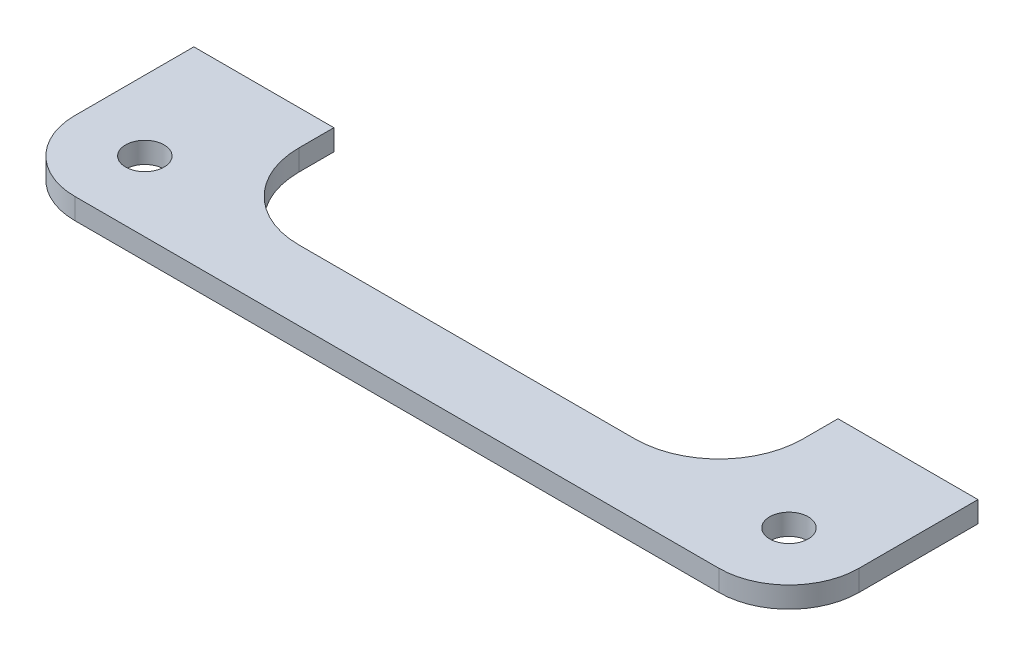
ISO-10303-21;
HEADER;
FILE_DESCRIPTION(('STEP AP214'),'2;1');
FILE_NAME('part.step','',(''),(''),'','','');
FILE_SCHEMA(('AUTOMOTIVE_DESIGN { 1 0 10303 214 1 1 1 1 }'));
ENDSEC;
DATA;
#1=APPLICATION_CONTEXT('core data for automotive mechanical design processes');
#2=APPLICATION_PROTOCOL_DEFINITION('international standard','automotive_design',2000,#1);
#3=PRODUCT_CONTEXT('',#1,'mechanical');
#4=PRODUCT('Part','Part','',(#3));
#5=PRODUCT_RELATED_PRODUCT_CATEGORY('part','',(#4));
#6=PRODUCT_DEFINITION_FORMATION('','',#4);
#7=PRODUCT_DEFINITION_CONTEXT('part definition',#1,'design');
#8=PRODUCT_DEFINITION('design','',#6,#7);
#9=PRODUCT_DEFINITION_SHAPE('','',#8);
#10=(LENGTH_UNIT() NAMED_UNIT(*) SI_UNIT(.MILLI.,.METRE.));
#11=(NAMED_UNIT(*) PLANE_ANGLE_UNIT() SI_UNIT($,.RADIAN.));
#12=(NAMED_UNIT(*) SI_UNIT($,.STERADIAN.) SOLID_ANGLE_UNIT());
#13=UNCERTAINTY_MEASURE_WITH_UNIT(LENGTH_MEASURE(1.E-05),#10,'distance_accuracy_value','');
#14=(GEOMETRIC_REPRESENTATION_CONTEXT(3) GLOBAL_UNCERTAINTY_ASSIGNED_CONTEXT((#13)) GLOBAL_UNIT_ASSIGNED_CONTEXT((#10,
#11,#12)) REPRESENTATION_CONTEXT('',''));
#15=CARTESIAN_POINT('',(0.,0.,0.));
#16=DIRECTION('',(0.,0.,1.));
#17=DIRECTION('',(1.,0.,0.));
#18=AXIS2_PLACEMENT_3D('',#15,#16,#17);
#19=CARTESIAN_POINT('',(102.,3.,-10.));
#20=DIRECTION('',(0.,1.,0.));
#21=DIRECTION('',(0.,0.,1.));
#22=AXIS2_PLACEMENT_3D('',#19,#20,#21);
#23=PLANE('',#22);
#24=CARTESIAN_POINT('',(10.,3.,-10.));
#25=DIRECTION('',(0.,1.,0.));
#26=DIRECTION('',(0.,0.,1.));
#27=AXIS2_PLACEMENT_3D('',#24,#25,#26);
#28=CIRCLE('',#27,2.75);
#29=CARTESIAN_POINT('',(10.,3.,-7.25));
#30=VERTEX_POINT('',#29);
#31=EDGE_CURVE('E156',#30,#30,#28,.T.);
#32=ORIENTED_EDGE('',*,*,#31,.F.);
#33=EDGE_LOOP('',(#32));
#34=FACE_BOUND('',#33,.T.);
#35=CARTESIAN_POINT('',(102.,3.,-10.));
#36=DIRECTION('',(0.,1.,0.));
#37=DIRECTION('',(0.,0.,1.));
#38=AXIS2_PLACEMENT_3D('',#35,#36,#37);
#39=CIRCLE('',#38,10.);
#40=CARTESIAN_POINT('',(102.,3.,0.));
#41=VERTEX_POINT('',#40);
#42=CARTESIAN_POINT('',(112.,3.,-10.0000000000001));
#43=VERTEX_POINT('',#42);
#44=EDGE_CURVE('E175',#41,#43,#39,.T.);
#45=ORIENTED_EDGE('',*,*,#44,.T.);
#46=DIRECTION('',(0.,0.,-1.));
#47=VECTOR('',#46,1.);
#48=CARTESIAN_POINT('',(112.,3.,-10.0000000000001));
#49=LINE('',#48,#47);
#50=CARTESIAN_POINT('',(112.,3.,-27.));
#51=VERTEX_POINT('',#50);
#52=EDGE_CURVE('E103',#43,#51,#49,.T.);
#53=ORIENTED_EDGE('',*,*,#52,.T.);
#54=DIRECTION('',(-1.,0.,0.));
#55=VECTOR('',#54,1.);
#56=CARTESIAN_POINT('',(112.,3.,-27.));
#57=LINE('',#56,#55);
#58=CARTESIAN_POINT('',(92.,3.,-27.));
#59=VERTEX_POINT('',#58);
#60=EDGE_CURVE('E202',#51,#59,#57,.T.);
#61=ORIENTED_EDGE('',*,*,#60,.T.);
#62=DIRECTION('',(0.,0.,1.));
#63=VECTOR('',#62,1.);
#64=CARTESIAN_POINT('',(92.,3.,-27.));
#65=LINE('',#64,#63);
#66=CARTESIAN_POINT('',(92.,3.,-22.0000000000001));
#67=VERTEX_POINT('',#66);
#68=EDGE_CURVE('E221',#59,#67,#65,.T.);
#69=ORIENTED_EDGE('',*,*,#68,.T.);
#70=CARTESIAN_POINT('',(80.,3.,-22.));
#71=DIRECTION('',(0.,-1.,0.));
#72=DIRECTION('',(0.,0.,1.));
#73=AXIS2_PLACEMENT_3D('',#70,#71,#72);
#74=CIRCLE('',#73,12.);
#75=CARTESIAN_POINT('',(79.9999999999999,3.,-10.));
#76=VERTEX_POINT('',#75);
#77=EDGE_CURVE('E218',#67,#76,#74,.T.);
#78=ORIENTED_EDGE('',*,*,#77,.T.);
#79=DIRECTION('',(-1.,0.,0.));
#80=VECTOR('',#79,1.);
#81=CARTESIAN_POINT('',(79.9999999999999,3.,-10.));
#82=LINE('',#81,#80);
#83=CARTESIAN_POINT('',(32.0000000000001,3.,-9.99999999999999));
#84=VERTEX_POINT('',#83);
#85=EDGE_CURVE('E220',#76,#84,#82,.T.);
#86=ORIENTED_EDGE('',*,*,#85,.T.);
#87=CARTESIAN_POINT('',(32.,3.,-22.));
#88=DIRECTION('',(0.,-1.,0.));
#89=DIRECTION('',(0.,0.,-1.));
#90=AXIS2_PLACEMENT_3D('',#87,#88,#89);
#91=CIRCLE('',#90,12.);
#92=CARTESIAN_POINT('',(20.,3.,-22.0000000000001));
#93=VERTEX_POINT('',#92);
#94=EDGE_CURVE('E223',#84,#93,#91,.T.);
#95=ORIENTED_EDGE('',*,*,#94,.T.);
#96=DIRECTION('',(0.,0.,-1.));
#97=VECTOR('',#96,1.);
#98=CARTESIAN_POINT('',(20.,3.,-22.0000000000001));
#99=LINE('',#98,#97);
#100=CARTESIAN_POINT('',(20.,3.,-27.));
#101=VERTEX_POINT('',#100);
#102=EDGE_CURVE('E229',#93,#101,#99,.T.);
#103=ORIENTED_EDGE('',*,*,#102,.T.);
#104=DIRECTION('',(-1.,0.,0.));
#105=VECTOR('',#104,1.);
#106=CARTESIAN_POINT('',(20.,3.,-27.));
#107=LINE('',#106,#105);
#108=CARTESIAN_POINT('',(0.,3.,-27.));
#109=VERTEX_POINT('',#108);
#110=EDGE_CURVE('E134',#101,#109,#107,.T.);
#111=ORIENTED_EDGE('',*,*,#110,.T.);
#112=DIRECTION('',(0.,0.,1.));
#113=VECTOR('',#112,1.);
#114=CARTESIAN_POINT('',(0.,3.,-27.));
#115=LINE('',#114,#113);
#116=CARTESIAN_POINT('',(0.,3.,-10.0000000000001));
#117=VERTEX_POINT('',#116);
#118=EDGE_CURVE('E128',#109,#117,#115,.T.);
#119=ORIENTED_EDGE('',*,*,#118,.T.);
#120=CARTESIAN_POINT('',(10.,3.,-10.));
#121=DIRECTION('',(0.,1.,0.));
#122=DIRECTION('',(0.,0.,-1.));
#123=AXIS2_PLACEMENT_3D('',#120,#121,#122);
#124=CIRCLE('',#123,10.);
#125=CARTESIAN_POINT('',(10.0000000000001,3.,0.));
#126=VERTEX_POINT('',#125);
#127=EDGE_CURVE('E132',#117,#126,#124,.T.);
#128=ORIENTED_EDGE('',*,*,#127,.T.);
#129=DIRECTION('',(1.,0.,0.));
#130=VECTOR('',#129,1.);
#131=CARTESIAN_POINT('',(10.0000000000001,3.,0.));
#132=LINE('',#131,#130);
#133=EDGE_CURVE('E48',#126,#41,#132,.T.);
#134=ORIENTED_EDGE('',*,*,#133,.T.);
#135=EDGE_LOOP('',(#45,#53,#61,#69,#78,#86,#95,#103,#111,#119,#128,#134));
#136=FACE_BOUND('',#135,.T.);
#137=CARTESIAN_POINT('',(102.,3.,-10.));
#138=DIRECTION('',(0.,1.,0.));
#139=DIRECTION('',(0.,0.,1.));
#140=AXIS2_PLACEMENT_3D('',#137,#138,#139);
#141=CIRCLE('',#140,2.75000000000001);
#142=CARTESIAN_POINT('',(102.,3.,-7.24999999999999));
#143=VERTEX_POINT('',#142);
#144=EDGE_CURVE('E272',#143,#143,#141,.T.);
#145=ORIENTED_EDGE('',*,*,#144,.F.);
#146=EDGE_LOOP('',(#145));
#147=FACE_BOUND('',#146,.T.);
#148=ADVANCED_FACE('F31',(#34,#136,#147),#23,.T.);
#149=CARTESIAN_POINT('',(102.,0.,-10.));
#150=DIRECTION('',(0.,1.,0.));
#151=DIRECTION('',(0.,0.,1.));
#152=AXIS2_PLACEMENT_3D('',#149,#150,#151);
#153=PLANE('',#152);
#154=CARTESIAN_POINT('',(10.,0.,-10.));
#155=DIRECTION('',(0.,1.,0.));
#156=DIRECTION('',(0.,0.,1.));
#157=AXIS2_PLACEMENT_3D('',#154,#155,#156);
#158=CIRCLE('',#157,2.75);
#159=CARTESIAN_POINT('',(10.,0.,-7.25));
#160=VERTEX_POINT('',#159);
#161=EDGE_CURVE('E277',#160,#160,#158,.T.);
#162=ORIENTED_EDGE('',*,*,#161,.T.);
#163=EDGE_LOOP('',(#162));
#164=FACE_BOUND('',#163,.T.);
#165=CARTESIAN_POINT('',(102.,0.,-10.));
#166=DIRECTION('',(0.,1.,0.));
#167=DIRECTION('',(0.,0.,1.));
#168=AXIS2_PLACEMENT_3D('',#165,#166,#167);
#169=CIRCLE('',#168,10.);
#170=CARTESIAN_POINT('',(102.,0.,0.));
#171=VERTEX_POINT('',#170);
#172=CARTESIAN_POINT('',(112.,0.,-10.0000000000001));
#173=VERTEX_POINT('',#172);
#174=EDGE_CURVE('E152',#171,#173,#169,.T.);
#175=ORIENTED_EDGE('',*,*,#174,.F.);
#176=DIRECTION('',(1.,0.,0.));
#177=VECTOR('',#176,1.);
#178=CARTESIAN_POINT('',(10.0000000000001,0.,0.));
#179=LINE('',#178,#177);
#180=CARTESIAN_POINT('',(10.0000000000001,0.,0.));
#181=VERTEX_POINT('',#180);
#182=EDGE_CURVE('E95',#181,#171,#179,.T.);
#183=ORIENTED_EDGE('',*,*,#182,.F.);
#184=CARTESIAN_POINT('',(10.,0.,-10.));
#185=DIRECTION('',(0.,1.,0.));
#186=DIRECTION('',(0.,0.,-1.));
#187=AXIS2_PLACEMENT_3D('',#184,#185,#186);
#188=CIRCLE('',#187,10.);
#189=CARTESIAN_POINT('',(0.,0.,-10.0000000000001));
#190=VERTEX_POINT('',#189);
#191=EDGE_CURVE('E89',#190,#181,#188,.T.);
#192=ORIENTED_EDGE('',*,*,#191,.F.);
#193=DIRECTION('',(0.,0.,1.));
#194=VECTOR('',#193,1.);
#195=CARTESIAN_POINT('',(0.,0.,-27.));
#196=LINE('',#195,#194);
#197=CARTESIAN_POINT('',(0.,0.,-27.));
#198=VERTEX_POINT('',#197);
#199=EDGE_CURVE('E142',#198,#190,#196,.T.);
#200=ORIENTED_EDGE('',*,*,#199,.F.);
#201=DIRECTION('',(-1.,0.,0.));
#202=VECTOR('',#201,1.);
#203=CARTESIAN_POINT('',(20.,0.,-27.));
#204=LINE('',#203,#202);
#205=CARTESIAN_POINT('',(20.,0.,-27.));
#206=VERTEX_POINT('',#205);
#207=EDGE_CURVE('E170',#206,#198,#204,.T.);
#208=ORIENTED_EDGE('',*,*,#207,.F.);
#209=DIRECTION('',(0.,0.,-1.));
#210=VECTOR('',#209,1.);
#211=CARTESIAN_POINT('',(20.,0.,-22.0000000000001));
#212=LINE('',#211,#210);
#213=CARTESIAN_POINT('',(20.,0.,-22.0000000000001));
#214=VERTEX_POINT('',#213);
#215=EDGE_CURVE('E168',#214,#206,#212,.T.);
#216=ORIENTED_EDGE('',*,*,#215,.F.);
#217=CARTESIAN_POINT('',(32.,0.,-22.));
#218=DIRECTION('',(0.,-1.,0.));
#219=DIRECTION('',(0.,0.,-1.));
#220=AXIS2_PLACEMENT_3D('',#217,#218,#219);
#221=CIRCLE('',#220,12.);
#222=CARTESIAN_POINT('',(32.0000000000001,0.,-9.99999999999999));
#223=VERTEX_POINT('',#222);
#224=EDGE_CURVE('E166',#223,#214,#221,.T.);
#225=ORIENTED_EDGE('',*,*,#224,.F.);
#226=DIRECTION('',(-1.,0.,0.));
#227=VECTOR('',#226,1.);
#228=CARTESIAN_POINT('',(79.9999999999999,0.,-10.));
#229=LINE('',#228,#227);
#230=CARTESIAN_POINT('',(79.9999999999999,0.,-10.));
#231=VERTEX_POINT('',#230);
#232=EDGE_CURVE('E164',#231,#223,#229,.T.);
#233=ORIENTED_EDGE('',*,*,#232,.F.);
#234=CARTESIAN_POINT('',(80.,0.,-22.));
#235=DIRECTION('',(0.,-1.,0.));
#236=DIRECTION('',(0.,0.,1.));
#237=AXIS2_PLACEMENT_3D('',#234,#235,#236);
#238=CIRCLE('',#237,12.);
#239=CARTESIAN_POINT('',(92.,0.,-22.0000000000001));
#240=VERTEX_POINT('',#239);
#241=EDGE_CURVE('E162',#240,#231,#238,.T.);
#242=ORIENTED_EDGE('',*,*,#241,.F.);
#243=DIRECTION('',(0.,0.,1.));
#244=VECTOR('',#243,1.);
#245=CARTESIAN_POINT('',(92.,0.,-27.));
#246=LINE('',#245,#244);
#247=CARTESIAN_POINT('',(92.,0.,-27.));
#248=VERTEX_POINT('',#247);
#249=EDGE_CURVE('E160',#248,#240,#246,.T.);
#250=ORIENTED_EDGE('',*,*,#249,.F.);
#251=DIRECTION('',(-1.,0.,0.));
#252=VECTOR('',#251,1.);
#253=CARTESIAN_POINT('',(112.,0.,-27.));
#254=LINE('',#253,#252);
#255=CARTESIAN_POINT('',(112.,0.,-27.));
#256=VERTEX_POINT('',#255);
#257=EDGE_CURVE('E158',#256,#248,#254,.T.);
#258=ORIENTED_EDGE('',*,*,#257,.F.);
#259=DIRECTION('',(0.,0.,-1.));
#260=VECTOR('',#259,1.);
#261=CARTESIAN_POINT('',(112.,0.,-10.0000000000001));
#262=LINE('',#261,#260);
#263=EDGE_CURVE('E155',#173,#256,#262,.T.);
#264=ORIENTED_EDGE('',*,*,#263,.F.);
#265=EDGE_LOOP('',(#175,#183,#192,#200,#208,#216,#225,#233,#242,#250,#258,#264));
#266=FACE_BOUND('',#265,.T.);
#267=CARTESIAN_POINT('',(102.,0.,-10.));
#268=DIRECTION('',(0.,1.,0.));
#269=DIRECTION('',(0.,0.,1.));
#270=AXIS2_PLACEMENT_3D('',#267,#268,#269);
#271=CIRCLE('',#270,2.75000000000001);
#272=CARTESIAN_POINT('',(102.,0.,-7.24999999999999));
#273=VERTEX_POINT('',#272);
#274=EDGE_CURVE('E275',#273,#273,#271,.T.);
#275=ORIENTED_EDGE('',*,*,#274,.T.);
#276=EDGE_LOOP('',(#275));
#277=FACE_BOUND('',#276,.T.);
#278=ADVANCED_FACE('F206',(#164,#266,#277),#153,.F.);
#279=CARTESIAN_POINT('',(102.,3.,-10.));
#280=DIRECTION('',(0.,-1.,0.));
#281=DIRECTION('',(0.,0.,-1.));
#282=AXIS2_PLACEMENT_3D('',#279,#280,#281);
#283=CYLINDRICAL_SURFACE('',#282,10.);
#284=ORIENTED_EDGE('',*,*,#174,.T.);
#285=DIRECTION('',(0.,-1.,0.));
#286=VECTOR('',#285,1.);
#287=CARTESIAN_POINT('',(112.,3.,-10.0000000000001));
#288=LINE('',#287,#286);
#289=EDGE_CURVE('E11',#43,#173,#288,.T.);
#290=ORIENTED_EDGE('',*,*,#289,.F.);
#291=ORIENTED_EDGE('',*,*,#44,.F.);
#292=DIRECTION('',(0.,-1.,0.));
#293=VECTOR('',#292,1.);
#294=CARTESIAN_POINT('',(102.,3.,0.));
#295=LINE('',#294,#293);
#296=EDGE_CURVE('E148',#41,#171,#295,.T.);
#297=ORIENTED_EDGE('',*,*,#296,.T.);
#298=EDGE_LOOP('',(#284,#290,#291,#297));
#299=FACE_BOUND('',#298,.T.);
#300=ADVANCED_FACE('F33',(#299),#283,.T.);
#301=CARTESIAN_POINT('',(112.,3.,-10.0000000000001));
#302=DIRECTION('',(-1.,0.,0.));
#303=DIRECTION('',(0.,0.,1.));
#304=AXIS2_PLACEMENT_3D('',#301,#302,#303);
#305=PLANE('',#304);
#306=ORIENTED_EDGE('',*,*,#263,.T.);
#307=DIRECTION('',(0.,-1.,0.));
#308=VECTOR('',#307,1.);
#309=CARTESIAN_POINT('',(112.,3.,-27.));
#310=LINE('',#309,#308);
#311=EDGE_CURVE('E40',#51,#256,#310,.T.);
#312=ORIENTED_EDGE('',*,*,#311,.F.);
#313=ORIENTED_EDGE('',*,*,#52,.F.);
#314=ORIENTED_EDGE('',*,*,#289,.T.);
#315=EDGE_LOOP('',(#306,#312,#313,#314));
#316=FACE_BOUND('',#315,.T.);
#317=ADVANCED_FACE('F370',(#316),#305,.F.);
#318=CARTESIAN_POINT('',(112.,3.,-27.));
#319=DIRECTION('',(0.,0.,1.));
#320=DIRECTION('',(1.,0.,0.));
#321=AXIS2_PLACEMENT_3D('',#318,#319,#320);
#322=PLANE('',#321);
#323=ORIENTED_EDGE('',*,*,#257,.T.);
#324=DIRECTION('',(0.,-1.,0.));
#325=VECTOR('',#324,1.);
#326=CARTESIAN_POINT('',(92.,3.,-27.));
#327=LINE('',#326,#325);
#328=EDGE_CURVE('E194',#59,#248,#327,.T.);
#329=ORIENTED_EDGE('',*,*,#328,.F.);
#330=ORIENTED_EDGE('',*,*,#60,.F.);
#331=ORIENTED_EDGE('',*,*,#311,.T.);
#332=EDGE_LOOP('',(#323,#329,#330,#331));
#333=FACE_BOUND('',#332,.T.);
#334=ADVANCED_FACE('F200',(#333),#322,.F.);
#335=CARTESIAN_POINT('',(92.,3.,-27.));
#336=DIRECTION('',(1.,0.,0.));
#337=DIRECTION('',(0.,0.,-1.));
#338=AXIS2_PLACEMENT_3D('',#335,#336,#337);
#339=PLANE('',#338);
#340=ORIENTED_EDGE('',*,*,#249,.T.);
#341=DIRECTION('',(0.,-1.,0.));
#342=VECTOR('',#341,1.);
#343=CARTESIAN_POINT('',(92.,3.,-22.0000000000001));
#344=LINE('',#343,#342);
#345=EDGE_CURVE('E191',#67,#240,#344,.T.);
#346=ORIENTED_EDGE('',*,*,#345,.F.);
#347=ORIENTED_EDGE('',*,*,#68,.F.);
#348=ORIENTED_EDGE('',*,*,#328,.T.);
#349=EDGE_LOOP('',(#340,#346,#347,#348));
#350=FACE_BOUND('',#349,.T.);
#351=ADVANCED_FACE('F212',(#350),#339,.F.);
#352=CARTESIAN_POINT('',(80.,3.,-22.));
#353=DIRECTION('',(0.,-1.,0.));
#354=DIRECTION('',(0.,0.,-1.));
#355=AXIS2_PLACEMENT_3D('',#352,#353,#354);
#356=CYLINDRICAL_SURFACE('',#355,12.);
#357=ORIENTED_EDGE('',*,*,#241,.T.);
#358=DIRECTION('',(0.,-1.,0.));
#359=VECTOR('',#358,1.);
#360=CARTESIAN_POINT('',(79.9999999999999,3.,-10.));
#361=LINE('',#360,#359);
#362=EDGE_CURVE('E188',#76,#231,#361,.T.);
#363=ORIENTED_EDGE('',*,*,#362,.F.);
#364=ORIENTED_EDGE('',*,*,#77,.F.);
#365=ORIENTED_EDGE('',*,*,#345,.T.);
#366=EDGE_LOOP('',(#357,#363,#364,#365));
#367=FACE_BOUND('',#366,.T.);
#368=ADVANCED_FACE('F216',(#367),#356,.F.);
#369=CARTESIAN_POINT('',(79.9999999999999,3.,-10.));
#370=DIRECTION('',(0.,0.,1.));
#371=DIRECTION('',(1.,0.,0.));
#372=AXIS2_PLACEMENT_3D('',#369,#370,#371);
#373=PLANE('',#372);
#374=ORIENTED_EDGE('',*,*,#232,.T.);
#375=DIRECTION('',(0.,-1.,0.));
#376=VECTOR('',#375,1.);
#377=CARTESIAN_POINT('',(32.0000000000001,3.,-9.99999999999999));
#378=LINE('',#377,#376);
#379=EDGE_CURVE('E185',#84,#223,#378,.T.);
#380=ORIENTED_EDGE('',*,*,#379,.F.);
#381=ORIENTED_EDGE('',*,*,#85,.F.);
#382=ORIENTED_EDGE('',*,*,#362,.T.);
#383=EDGE_LOOP('',(#374,#380,#381,#382));
#384=FACE_BOUND('',#383,.T.);
#385=ADVANCED_FACE('F335',(#384),#373,.F.);
#386=CARTESIAN_POINT('',(32.,3.,-22.));
#387=DIRECTION('',(0.,-1.,0.));
#388=DIRECTION('',(0.,0.,-1.));
#389=AXIS2_PLACEMENT_3D('',#386,#387,#388);
#390=CYLINDRICAL_SURFACE('',#389,12.);
#391=ORIENTED_EDGE('',*,*,#224,.T.);
#392=DIRECTION('',(0.,-1.,0.));
#393=VECTOR('',#392,1.);
#394=CARTESIAN_POINT('',(20.,3.,-22.0000000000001));
#395=LINE('',#394,#393);
#396=EDGE_CURVE('E182',#93,#214,#395,.T.);
#397=ORIENTED_EDGE('',*,*,#396,.F.);
#398=ORIENTED_EDGE('',*,*,#94,.F.);
#399=ORIENTED_EDGE('',*,*,#379,.T.);
#400=EDGE_LOOP('',(#391,#397,#398,#399));
#401=FACE_BOUND('',#400,.T.);
#402=ADVANCED_FACE('F326',(#401),#390,.F.);
#403=CARTESIAN_POINT('',(20.,3.,-22.0000000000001));
#404=DIRECTION('',(-1.,0.,0.));
#405=DIRECTION('',(0.,0.,1.));
#406=AXIS2_PLACEMENT_3D('',#403,#404,#405);
#407=PLANE('',#406);
#408=ORIENTED_EDGE('',*,*,#215,.T.);
#409=DIRECTION('',(0.,-1.,0.));
#410=VECTOR('',#409,1.);
#411=CARTESIAN_POINT('',(20.,3.,-27.));
#412=LINE('',#411,#410);
#413=EDGE_CURVE('E179',#101,#206,#412,.T.);
#414=ORIENTED_EDGE('',*,*,#413,.F.);
#415=ORIENTED_EDGE('',*,*,#102,.F.);
#416=ORIENTED_EDGE('',*,*,#396,.T.);
#417=EDGE_LOOP('',(#408,#414,#415,#416));
#418=FACE_BOUND('',#417,.T.);
#419=ADVANCED_FACE('F235',(#418),#407,.F.);
#420=CARTESIAN_POINT('',(20.,3.,-27.));
#421=DIRECTION('',(0.,0.,1.));
#422=DIRECTION('',(1.,0.,0.));
#423=AXIS2_PLACEMENT_3D('',#420,#421,#422);
#424=PLANE('',#423);
#425=ORIENTED_EDGE('',*,*,#207,.T.);
#426=DIRECTION('',(0.,-1.,0.));
#427=VECTOR('',#426,1.);
#428=CARTESIAN_POINT('',(0.,3.,-27.));
#429=LINE('',#428,#427);
#430=EDGE_CURVE('E143',#109,#198,#429,.T.);
#431=ORIENTED_EDGE('',*,*,#430,.F.);
#432=ORIENTED_EDGE('',*,*,#110,.F.);
#433=ORIENTED_EDGE('',*,*,#413,.T.);
#434=EDGE_LOOP('',(#425,#431,#432,#433));
#435=FACE_BOUND('',#434,.T.);
#436=ADVANCED_FACE('F239',(#435),#424,.F.);
#437=CARTESIAN_POINT('',(0.,3.,-27.));
#438=DIRECTION('',(1.,0.,0.));
#439=DIRECTION('',(0.,0.,-1.));
#440=AXIS2_PLACEMENT_3D('',#437,#438,#439);
#441=PLANE('',#440);
#442=ORIENTED_EDGE('',*,*,#199,.T.);
#443=DIRECTION('',(0.,-1.,0.));
#444=VECTOR('',#443,1.);
#445=CARTESIAN_POINT('',(0.,3.,-10.0000000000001));
#446=LINE('',#445,#444);
#447=EDGE_CURVE('E139',#117,#190,#446,.T.);
#448=ORIENTED_EDGE('',*,*,#447,.F.);
#449=ORIENTED_EDGE('',*,*,#118,.F.);
#450=ORIENTED_EDGE('',*,*,#430,.T.);
#451=EDGE_LOOP('',(#442,#448,#449,#450));
#452=FACE_BOUND('',#451,.T.);
#453=ADVANCED_FACE('F140',(#452),#441,.F.);
#454=CARTESIAN_POINT('',(10.,3.,-10.));
#455=DIRECTION('',(0.,-1.,0.));
#456=DIRECTION('',(0.,0.,-1.));
#457=AXIS2_PLACEMENT_3D('',#454,#455,#456);
#458=CYLINDRICAL_SURFACE('',#457,10.);
#459=ORIENTED_EDGE('',*,*,#191,.T.);
#460=DIRECTION('',(0.,-1.,0.));
#461=VECTOR('',#460,1.);
#462=CARTESIAN_POINT('',(10.0000000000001,3.,0.));
#463=LINE('',#462,#461);
#464=EDGE_CURVE('E144',#126,#181,#463,.T.);
#465=ORIENTED_EDGE('',*,*,#464,.F.);
#466=ORIENTED_EDGE('',*,*,#127,.F.);
#467=ORIENTED_EDGE('',*,*,#447,.T.);
#468=EDGE_LOOP('',(#459,#465,#466,#467));
#469=FACE_BOUND('',#468,.T.);
#470=ADVANCED_FACE('F146',(#469),#458,.T.);
#471=CARTESIAN_POINT('',(10.0000000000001,3.,0.));
#472=DIRECTION('',(0.,0.,-1.));
#473=DIRECTION('',(-1.,0.,0.));
#474=AXIS2_PLACEMENT_3D('',#471,#472,#473);
#475=PLANE('',#474);
#476=ORIENTED_EDGE('',*,*,#182,.T.);
#477=ORIENTED_EDGE('',*,*,#296,.F.);
#478=ORIENTED_EDGE('',*,*,#133,.F.);
#479=ORIENTED_EDGE('',*,*,#464,.T.);
#480=EDGE_LOOP('',(#476,#477,#478,#479));
#481=FACE_BOUND('',#480,.T.);
#482=ADVANCED_FACE('F243',(#481),#475,.F.);
#483=CARTESIAN_POINT('',(10.,3.,-10.));
#484=DIRECTION('',(0.,-1.,0.));
#485=DIRECTION('',(0.,0.,-1.));
#486=AXIS2_PLACEMENT_3D('',#483,#484,#485);
#487=CYLINDRICAL_SURFACE('',#486,2.75);
#488=ORIENTED_EDGE('',*,*,#31,.T.);
#489=EDGE_LOOP('',(#488));
#490=FACE_BOUND('',#489,.T.);
#491=ORIENTED_EDGE('',*,*,#161,.F.);
#492=EDGE_LOOP('',(#491));
#493=FACE_BOUND('',#492,.T.);
#494=ADVANCED_FACE('F245',(#490,#493),#487,.F.);
#495=CARTESIAN_POINT('',(102.,3.,-10.));
#496=DIRECTION('',(0.,-1.,0.));
#497=DIRECTION('',(0.,0.,-1.));
#498=AXIS2_PLACEMENT_3D('',#495,#496,#497);
#499=CYLINDRICAL_SURFACE('',#498,2.75000000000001);
#500=ORIENTED_EDGE('',*,*,#144,.T.);
#501=EDGE_LOOP('',(#500));
#502=FACE_BOUND('',#501,.T.);
#503=ORIENTED_EDGE('',*,*,#274,.F.);
#504=EDGE_LOOP('',(#503));
#505=FACE_BOUND('',#504,.T.);
#506=ADVANCED_FACE('F251',(#502,#505),#499,.F.);
#507=CLOSED_SHELL('',(#148,#278,#300,#317,#334,#351,#368,#385,#402,#419,#436,#453,#470,#482,
#494,#506));
#508=MANIFOLD_SOLID_BREP('B2',#507);
#509=ADVANCED_BREP_SHAPE_REPRESENTATION('',(#18,#508),#14);
#510=SHAPE_DEFINITION_REPRESENTATION(#9,#509);
ENDSEC;
END-ISO-10303-21;
